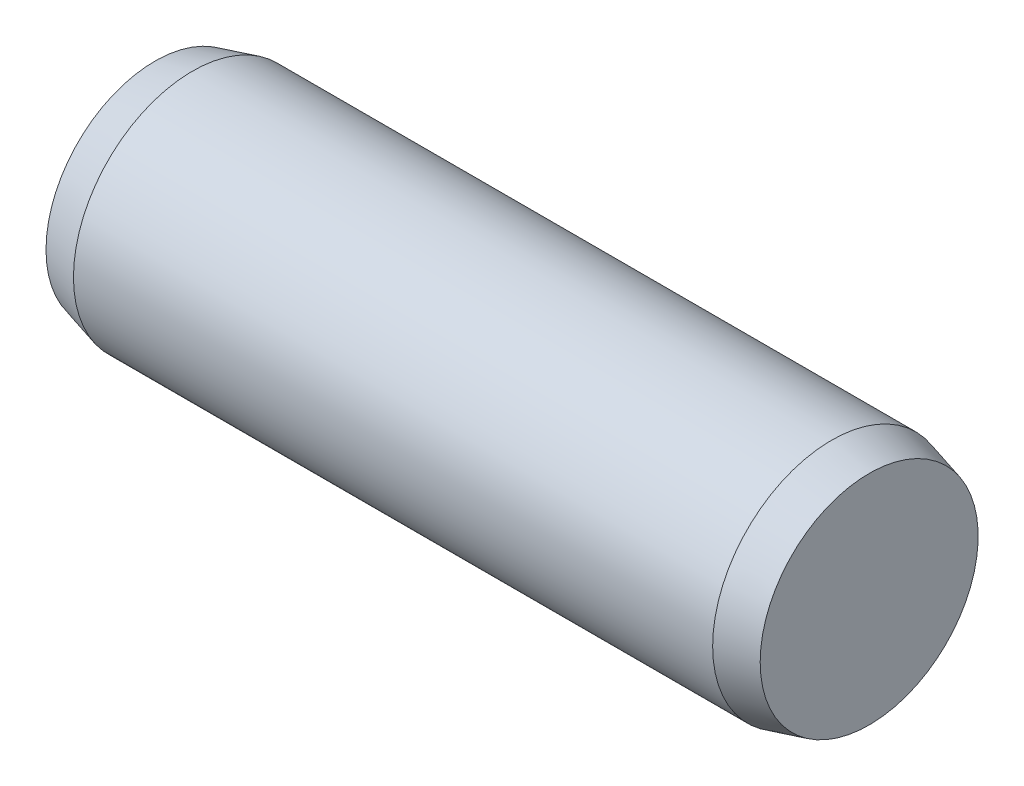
from build123d import *


with BuildPart() as part:
    # Sketch1 → Base-Revolve (revolve)
    with BuildSketch(Plane.XY, mode=Mode.PRIVATE) as base_revolve_sk:
        Polygon((0, 0), (12, 0), (12, 1.831192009), (11.37, 2), (0.63, 2), (0, 1.831192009), align=None)
    revolve(base_revolve_sk.sketch.rotate(Axis((-6.35, 0, 0), (1, 0, 0)), 90), axis=Axis((-6.35, 0, 0), (1, 0, 0)))


solid = part.part
